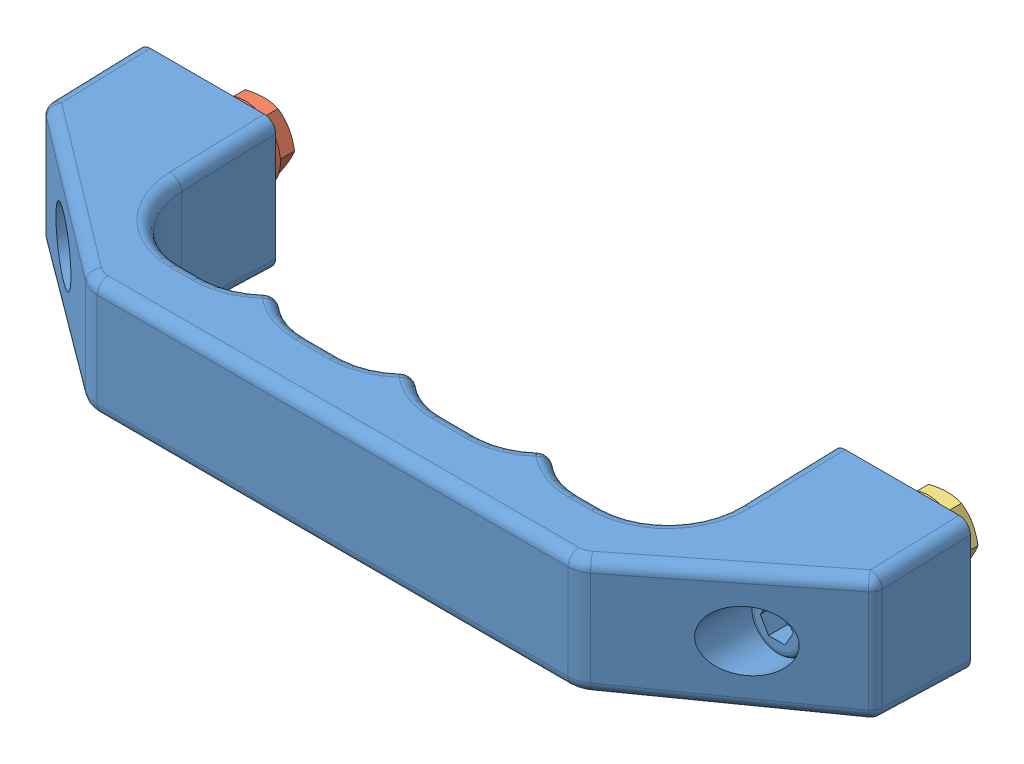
SolidWorks assembly AG1-120.sldasm, configuration Default (file format 15000). Lengths in mm.
Overall size (146 23 49).
3 component instances, 3 part files, 0 mates.
Components (placement in the parent):
- AG1-120_01-1: AG1-120_01.SLDPRT [Default] at origin size (146 23 49)
- AG1-120_02-1: AG1-120_02.SLDPRT [Default] at (0 0 -4) x (1 0 0) z (0 -1 0) size (12.5 5 12.5)
- AG1-120_03-1: AG1-120_03.SLDPRT [Default] at (120 0 -4) x (1 0 0) z (0 -1 0) size (12.5 5 12.5)
